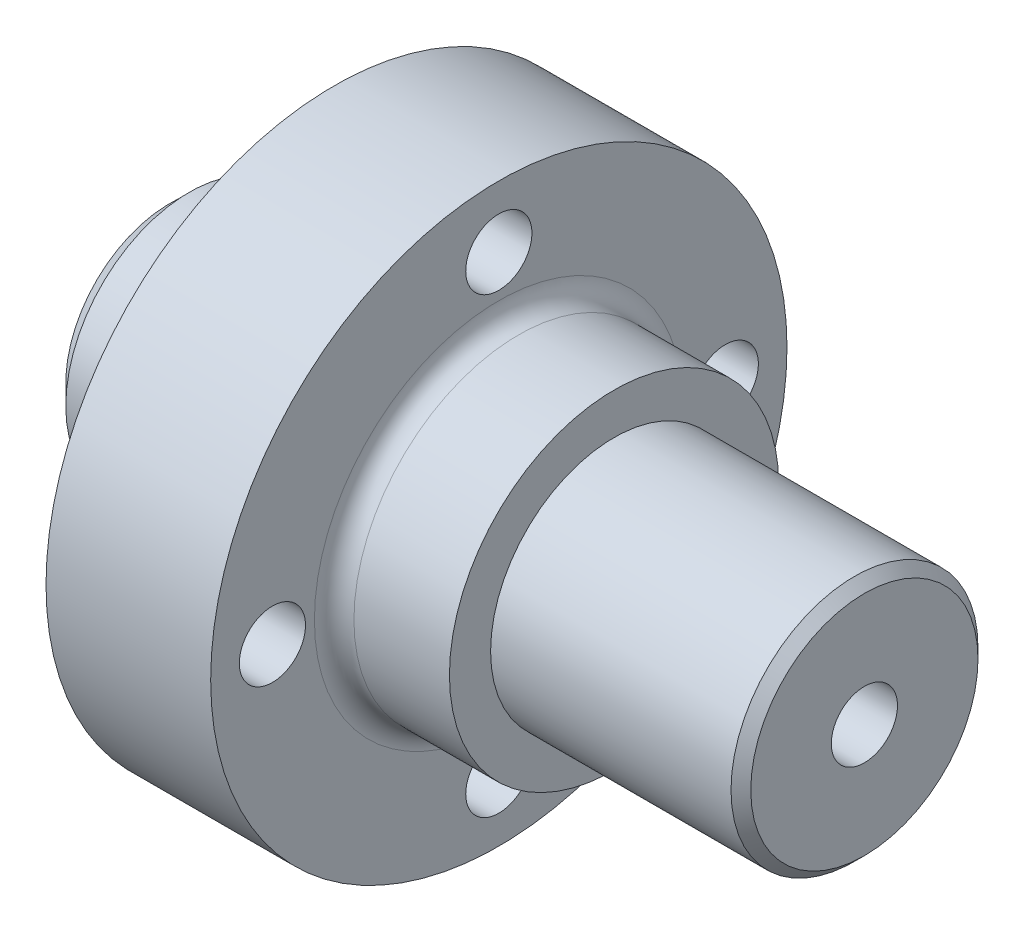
from build123d import *

# Parameters (mm, degrees)
SKETCH1_R                   = 9.525
BOSS_EXTRUDE1_DEPTH         = 12.7
SKETCH2_R                   = 22.225
BOSS_EXTRUDE2_DEPTH         = 12.7
F_1_4_20_TAPPED_HOLE1_D     = 5.1054
CHAMFER1_SIZE               = 1.524
SKETCH5_R                   = 12.7
BOSS_EXTRUDE3_DEPTH         = 8.89
SKETCH6_R                   = 9.525
BOSS_EXTRUDE4_DEPTH         = 19.304
F_1_4_20_TAPPED_HOLE2_D     = 5.1054
F_1_4_20_TAPPED_HOLE2_DEPTH = 16.51
F_1_4_20_TAPPED_HOLE2_TIP   = 1.533816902
FILLET1_R                   = 1.524
CHAMFER2_SIZE               = 0.762


with BuildPart() as part:
    # Sketch1 → Boss-Extrude1 (new body)
    with BuildSketch(Plane(origin=(0, 0, 0), x_dir=(0, 0, -1), z_dir=(1, 0, 0))):
        Circle(SKETCH1_R)
    extrude(amount=BOSS_EXTRUDE1_DEPTH)

    # Sketch2 → Boss-Extrude2 (add)
    with BuildSketch(Plane(origin=(12.7, 0, 0), x_dir=(0, 0, -1), z_dir=(1, 0, 0))):
        Circle(SKETCH2_R)
    extrude(amount=BOSS_EXTRUDE2_DEPTH)

    # 1_4-20 Tapped Hole1 (through all)
    with Locations(Plane.ZY.offset(-12.7)):
        with Locations((0, 17.4625), (17.4625, 0), (0, -17.4625), (-17.4625, 0)):
            Hole(F_1_4_20_TAPPED_HOLE1_D / 2)

    # Chamfer1
    chamfer1_edges = [part.edges().sort_by_distance(p)[0] for p in [
        (0, 0, 9.525),
    ]]
    chamfer(chamfer1_edges, length=CHAMFER1_SIZE)

    # Sketch5 → Boss-Extrude3 (add)
    with BuildSketch(Plane(origin=(25.4, 0, 0), x_dir=(0, 0, -1), z_dir=(1, 0, 0))):
        Circle(SKETCH5_R)
    extrude(amount=BOSS_EXTRUDE3_DEPTH)

    # Sketch6 → Boss-Extrude4 (add)
    with BuildSketch(Plane(origin=(34.29, 0, 0), x_dir=(0, 0, -1), z_dir=(1, 0, 0))):
        Circle(SKETCH6_R)
    extrude(amount=BOSS_EXTRUDE4_DEPTH)

    # 1_4-20 Tapped Hole2
    with Locations(Plane(origin=(53.594, 0, 0), x_dir=(0, 0, -1), z_dir=(1, 0, 0))):
        with Locations((0, 0)):
            Hole(F_1_4_20_TAPPED_HOLE2_D / 2, depth=F_1_4_20_TAPPED_HOLE2_DEPTH)
            with Locations((0, 0, -(F_1_4_20_TAPPED_HOLE2_DEPTH + F_1_4_20_TAPPED_HOLE2_TIP / 2))):  # 118° drill point
                Cone(0, F_1_4_20_TAPPED_HOLE2_D / 2, F_1_4_20_TAPPED_HOLE2_TIP, mode=Mode.SUBTRACT)

    # Fillet1
    fillet1_edges = [part.edges().sort_by_distance(p)[0] for p in [
        (25.4, 0, 12.7),
    ]]
    fillet(fillet1_edges, radius=FILLET1_R)

    # Chamfer2
    chamfer2_edges = [part.edges().sort_by_distance(p)[0] for p in [
        (53.594, 0, 9.525),
    ]]
    chamfer(chamfer2_edges, length=CHAMFER2_SIZE)


solid = part.part
